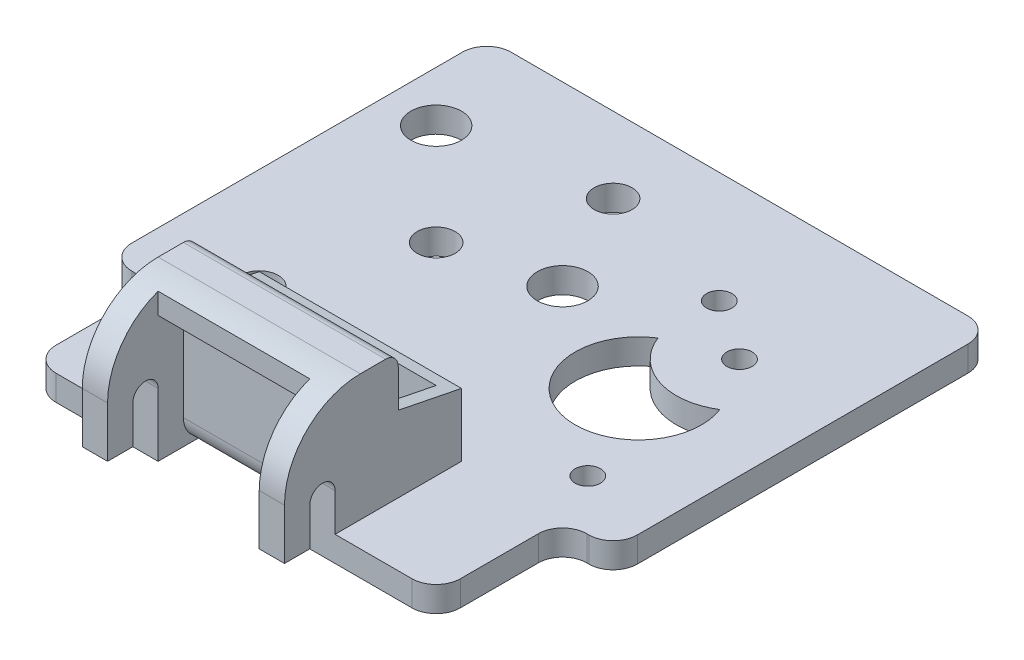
from build123d import *

# Parameters (mm, degrees)
SKETCH1_R                   = 1.5875
SKETCH1_R_2                 = 1.190625
SKETCH1_R_3                 = 0.79375
EXTRUDE1_DEPTH              = 1.5875
EXTRUDE10_DEPTH             = 6.35
SKETCH4_W                   = 9.525
SKETCH4_H                   = 5.91197362
EXTRUDE11_DEPTH             = 12.7
FILLET1_R                   = 1.5875
SKETCH5_W                   = 11.1125
SKETCH5_H                   = 3.175
EXTRUDE12_DEPTH             = 2.54
EXTRUDE12_DIRECTION_2_REACH = 51.52
SKETCH6_W                   = 9.525
SKETCH6_H                   = 1.5875
EXTRUDE14_DEPTH             = 1.5875
EXTRUDE15_DEPTH             = 6.35


with BuildPart() as part:
    # Sketch1 → Extrude1 (new body)
    with BuildSketch(Plane(origin=(0, 0, 0), x_dir=(1, 0, 0), z_dir=(0, 1, 0))):
        with BuildLine():
            Line((-41.520591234, -15.92597277), (-41.520591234, -11.03647277))
            ThreePointArc((-41.520591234, -11.03647277), (-41.966960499, -9.958842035), (-43.044591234, -9.51247277))
            Line((-43.044591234, -9.51247277), (-43.171591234, -9.51247277))
            ThreePointArc((-43.171591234, -9.51247277), (-44.249221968, -9.066103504), (-44.695591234, -7.98847277))
            Line((-44.695591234, -7.98847277), (-44.695591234, 12.77602723))
            ThreePointArc((-44.695591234, 12.77602723), (-44.249221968, 13.853657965), (-43.171591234, 14.30002723))
            Line((-43.171591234, 14.30002723), (-14.469591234, 14.30002723))
            ThreePointArc((-14.469591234, 14.30002723), (-13.391960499, 13.853657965), (-12.945591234, 12.77602723))
            Line((-12.945591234, 12.77602723), (-12.945591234, -7.98847277))
            ThreePointArc((-12.945591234, -7.98847277), (-13.391960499, -9.066103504), (-14.469591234, -9.51247277))
            Line((-14.469591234, -9.51247277), (-14.596591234, -9.51247277))
            ThreePointArc((-14.596591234, -9.51247277), (-15.674221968, -9.958842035), (-16.120591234, -11.03647277))
            Line((-16.120591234, -11.03647277), (-16.120591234, -15.92597277))
            ThreePointArc((-16.120591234, -15.92597277), (-16.566960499, -17.003603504), (-17.644591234, -17.44997277))
            Line((-17.644591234, -17.44997277), (-39.996591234, -17.44997277))
            ThreePointArc((-39.996591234, -17.44997277), (-41.074221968, -17.003603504), (-41.520591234, -15.92597277))
        make_face()
        with Locations(Location((-41.520591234, 7.95002723, 0), (0, 0, 270))):
            Circle(SKETCH1_R, mode=Mode.SUBTRACT)
        with Locations(Location((-35.170591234, 1.60002723, 0), (0, 0, 270))):
            Circle(SKETCH1_R_2, mode=Mode.SUBTRACT)
        with Locations(Location((-38.345591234, -6.33747277, 0), (0, 0, 270))):
            Circle(SKETCH1_R_2, mode=Mode.SUBTRACT)
        with Locations(Location((-31.995591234, 9.53752723, 0), (0, 0, 270))):
            Circle(SKETCH1_R_2, mode=Mode.SUBTRACT)
        with Locations(Location((-28.820591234, 3.18752723, 0), (0, 0, 270))):
            Circle(SKETCH1_R, mode=Mode.SUBTRACT)
        with Locations(Location((-23.105591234, 7.31502723, 0), (0, 0, 270))):
            Circle(SKETCH1_R_3, mode=Mode.SUBTRACT)
        with Locations(Location((-19.295591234, 4.77502723, 0), (0, 0, 270))):
            Circle(SKETCH1_R_3, mode=Mode.SUBTRACT)
        with Locations(Location((-17.708091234, -6.33747277, 0), (0, 0, 270))):
            Circle(SKETCH1_R_3, mode=Mode.SUBTRACT)
        with BuildLine():
            ThreePointArc((-23.005764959, 3.365918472), (-22.13812018, -3.752559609), (-17.172917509, 1.421635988))
            ThreePointArc((-17.172917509, 1.421635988), (-20.55062018, 1.009940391), (-23.005764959, 3.365918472))
        make_face(mode=Mode.SUBTRACT)
    extrude(amount=EXTRUDE1_DEPTH)

    # Sketch3 → Extrude10 (add, symmetric)
    with BuildSketch(Plane.ZY.offset(28.820591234)):
        with BuildLine():
            Line((9.51247277, 1.5875), (17.44997277, 1.5875))
            Line((17.44997277, 1.5875), (17.44997277, 3.96875))
            ThreePointArc((17.44997277, 3.96875), (18.24372277, 4.7625), (19.03747277, 3.96875))
            Line((19.03747277, 3.96875), (19.03747277, 1.5875))
            Line((19.03747277, 1.5875), (20.62497277, 1.5875))
            Line((20.62497277, 1.5875), (20.62497277, 4.7625))
            ThreePointArc((20.62497277, 4.7625), (19.230068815, 8.130096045), (15.86247277, 9.525))
            Line((15.86247277, 9.525), (14.27497277, 9.525))
            ThreePointArc((14.27497277, 9.525), (13.713706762, 9.292516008), (13.48122277, 8.73125))
            Line((13.48122277, 8.73125), (13.48122277, 6.35))
            Line((13.48122277, 6.35), (9.51247277, 5.55625))
            Line((9.51247277, 5.55625), (9.51247277, 1.5875))
        make_face()
    extrude(amount=EXTRUDE10_DEPTH, both=True)

    # Sketch4 → Extrude11 (cut)
    with BuildSketch(Plane(origin=(0, 0, 0), x_dir=(1, 0, 0), z_dir=(0, 1, 0))):
        with Locations((-28.820591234, -18.81845958)):
            Rectangle(SKETCH4_W, SKETCH4_H)
    extrude(amount=EXTRUDE11_DEPTH, mode=Mode.SUBTRACT)

    # Fillet1
    fillet1_edges = [part.edges().sort_by_distance(p)[0] for p in [
        (-28.820591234, 0, 15.86247277),
    ]]
    fillet(fillet1_edges, radius=FILLET1_R)

    # Sketch5 → Extrude12 (cut)
    with BuildSketch(Plane(origin=(0, 4.1275, 0), x_dir=(-1, 0, 0), z_dir=(0, 1, 0))):
        with Locations((28.820591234, 11.89372277)):
            Rectangle(SKETCH5_W, SKETCH5_H)
    extrude(amount=-EXTRUDE12_DEPTH, mode=Mode.SUBTRACT)

    # Extrude12 direction 2: up to this plane
    extrude12_direction_2_end = Plane(origin=(-35.170591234, 5.55625, 9.51247277), z_dir=(0, -0.9805806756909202, 0.19611613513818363))
    # Sketch5 → Extrude12 direction 2 (cut, up to the surface)
    with BuildSketch(Plane(origin=(0, 4.1275, 0), x_dir=(-1, 0, 0), z_dir=(0, 1, 0)), mode=Mode.PRIVATE) as extrude12_direction_2_sk1:
        with Locations((28.820591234, 11.89372277)):
            Rectangle(SKETCH5_W, SKETCH5_H)
    extrude12_direction_2_tool1 = split(extrude(extrude12_direction_2_sk1.sketch, amount=EXTRUDE12_DIRECTION_2_REACH, mode=Mode.PRIVATE), bisect_by=extrude12_direction_2_end, keep=Keep.BOTH, mode=Mode.PRIVATE)
    add(extrude12_direction_2_tool1.solids().sort_by_distance((-28.820591, 4.1275, 11.893723))[0], mode=Mode.SUBTRACT)

    # Sketch6 → Extrude14 (add)
    with BuildSketch(Plane(origin=(-33.583091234, 9.525, 15.86247277), x_dir=(1, 0, 0), z_dir=(0, 0, 1))):
        with Locations((4.7625, -0.79375)):
            Rectangle(SKETCH6_W, SKETCH6_H)
    extrude(amount=EXTRUDE14_DEPTH)

    # Sketch7 → Extrude15 (cut, symmetric)
    with BuildSketch(Plane.ZY.offset(28.820591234)):
        with BuildLine():
            Line((14.27497277, 9.525), (15.86247277, 9.525))
            ThreePointArc((15.86247277, 9.525), (19.230068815, 8.130096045), (20.62497277, 4.7625))
            Line((20.62497277, 4.7625), (20.62497277, 1.5875))
            Line((20.62497277, 1.5875), (22.228638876, 1.5875))
            Line((22.228638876, 1.5875), (22.228638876, 10.947609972))
            Line((22.228638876, 10.947609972), (14.27497277, 10.947609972))
            Line((14.27497277, 10.947609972), (14.27497277, 9.525))
        make_face()
    extrude(amount=EXTRUDE15_DEPTH, both=True, mode=Mode.SUBTRACT)


solid = part.part
